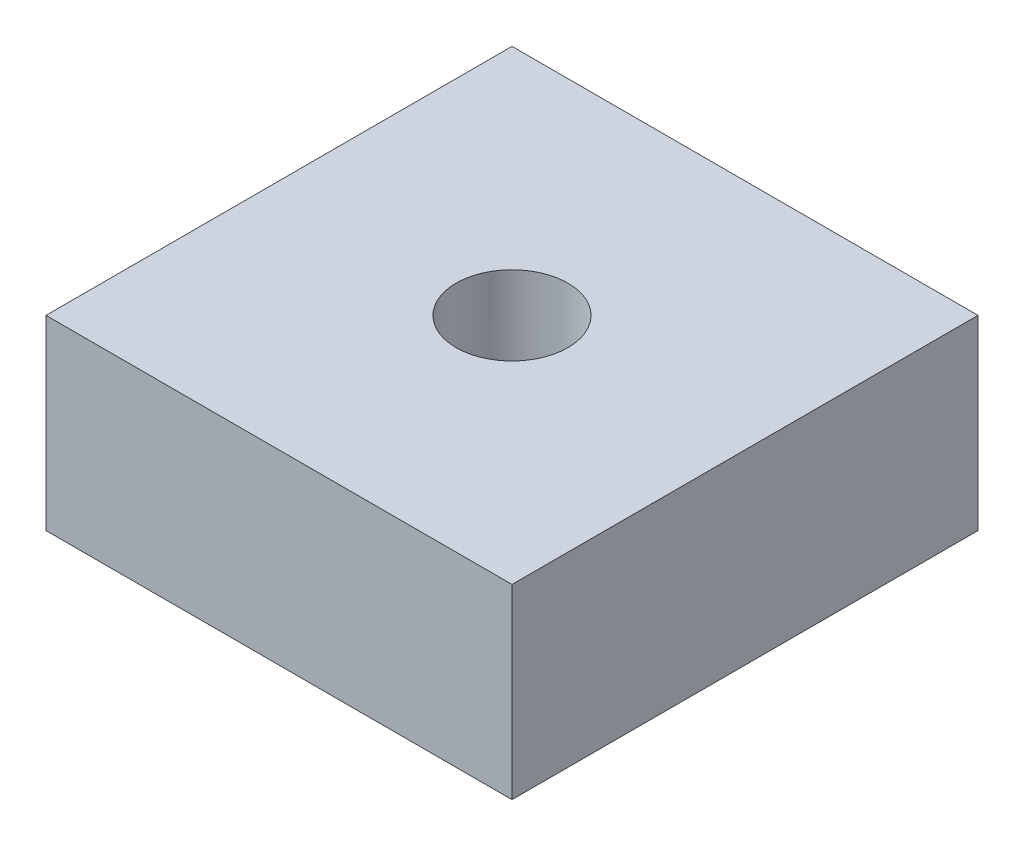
from build123d import *

# Parameters (mm, degrees)
SKETCH1_W           = 25
SKETCH1_H           = 25
BOSS_EXTRUDE1_DEPTH = 10
CUT_EXTRUDE1_REACH  = 22.31
SKETCH2_R           = 3


with BuildPart() as part:
    # Sketch1 → Boss-Extrude1 (new body)
    with BuildSketch(Plane(origin=(0, 0, 0), x_dir=(1, 0, 0), z_dir=(0, 1, 0))):
        Rectangle(SKETCH1_W, SKETCH1_H)
    extrude(amount=BOSS_EXTRUDE1_DEPTH)

    # Sketch2 → Cut-Extrude1 (cut, up to next)
    with BuildSketch(Plane(origin=(0, 10, 0), x_dir=(1, 0, 0), z_dir=(0, 1, 0)), mode=Mode.PRIVATE) as cut_extrude1_sk1:
        with Locations(Location((0, 0, 0), (0, 0, 270))):
            Circle(SKETCH2_R)
    cut_extrude1_tool1 = extrude(cut_extrude1_sk1.sketch, amount=-CUT_EXTRUDE1_REACH, mode=Mode.PRIVATE) & part.part
    add(cut_extrude1_tool1.solids().sort_by_distance((0, 10, 0))[0], mode=Mode.SUBTRACT)


solid = part.part
